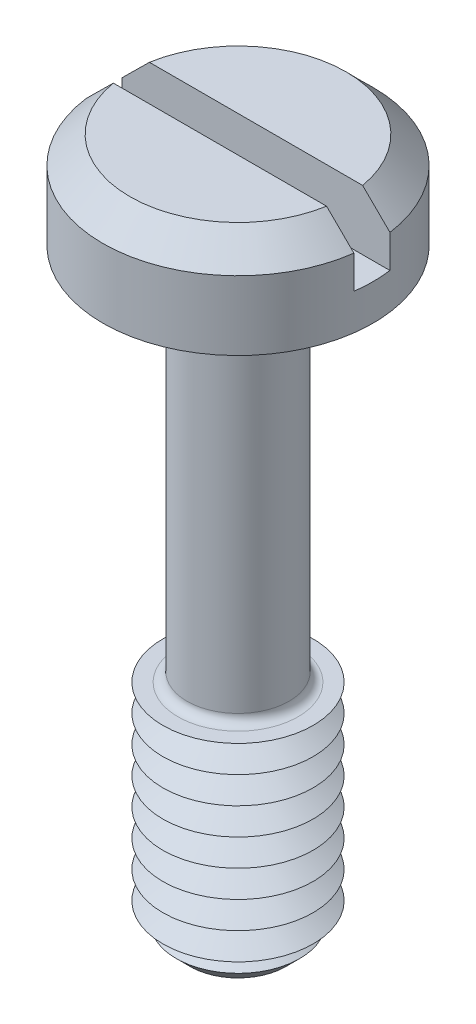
ISO-10303-21;
HEADER;
FILE_DESCRIPTION(('STEP AP214'),'2;1');
FILE_NAME('part.step','',(''),(''),'','','');
FILE_SCHEMA(('AUTOMOTIVE_DESIGN { 1 0 10303 214 1 1 1 1 }'));
ENDSEC;
DATA;
#1=APPLICATION_CONTEXT('core data for automotive mechanical design processes');
#2=APPLICATION_PROTOCOL_DEFINITION('international standard','automotive_design',2000,#1);
#3=PRODUCT_CONTEXT('',#1,'mechanical');
#4=PRODUCT('Part','Part','',(#3));
#5=PRODUCT_RELATED_PRODUCT_CATEGORY('part','',(#4));
#6=PRODUCT_DEFINITION_FORMATION('','',#4);
#7=PRODUCT_DEFINITION_CONTEXT('part definition',#1,'design');
#8=PRODUCT_DEFINITION('design','',#6,#7);
#9=PRODUCT_DEFINITION_SHAPE('','',#8);
#10=(LENGTH_UNIT() NAMED_UNIT(*) SI_UNIT(.MILLI.,.METRE.));
#11=(NAMED_UNIT(*) PLANE_ANGLE_UNIT() SI_UNIT($,.RADIAN.));
#12=(NAMED_UNIT(*) SI_UNIT($,.STERADIAN.) SOLID_ANGLE_UNIT());
#13=UNCERTAINTY_MEASURE_WITH_UNIT(LENGTH_MEASURE(1.E-05),#10,'distance_accuracy_value','');
#14=(GEOMETRIC_REPRESENTATION_CONTEXT(3) GLOBAL_UNCERTAINTY_ASSIGNED_CONTEXT((#13)) GLOBAL_UNIT_ASSIGNED_CONTEXT((#10,
#11,#12)) REPRESENTATION_CONTEXT('',''));
#15=CARTESIAN_POINT('',(0.,0.,0.));
#16=DIRECTION('',(0.,0.,1.));
#17=DIRECTION('',(1.,0.,0.));
#18=AXIS2_PLACEMENT_3D('',#15,#16,#17);
#19=CARTESIAN_POINT('',(0.,1.6,0.));
#20=DIRECTION('',(0.,1.,0.));
#21=DIRECTION('',(0.,0.,1.));
#22=AXIS2_PLACEMENT_3D('',#19,#20,#21);
#23=PLANE('',#22);
#24=DIRECTION('',(-1.,0.,0.));
#25=VECTOR('',#24,1.);
#26=CARTESIAN_POINT('',(2.25,1.6,-0.3));
#27=LINE('',#26,#25);
#28=CARTESIAN_POINT('',(1.77482393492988,1.6,-0.3));
#29=VERTEX_POINT('',#28);
#30=CARTESIAN_POINT('',(-1.77482393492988,1.6,-0.3));
#31=VERTEX_POINT('',#30);
#32=EDGE_CURVE('E110',#29,#31,#27,.T.);
#33=ORIENTED_EDGE('',*,*,#32,.F.);
#34=CARTESIAN_POINT('',(0.,1.6,0.));
#35=DIRECTION('',(0.,1.,0.));
#36=DIRECTION('',(0.,0.,1.));
#37=AXIS2_PLACEMENT_3D('',#34,#35,#36);
#38=CIRCLE('',#37,1.8);
#39=EDGE_CURVE('E113',#29,#31,#38,.T.);
#40=ORIENTED_EDGE('',*,*,#39,.T.);
#41=EDGE_LOOP('',(#33,#40));
#42=FACE_BOUND('',#41,.T.);
#43=ADVANCED_FACE('F39',(#42),#23,.T.);
#44=CARTESIAN_POINT('',(0.,1.6,0.));
#45=DIRECTION('',(0.,-1.,0.));
#46=DIRECTION('',(0.,0.,-1.));
#47=AXIS2_PLACEMENT_3D('',#44,#45,#46);
#48=CONICAL_SURFACE('',#47,1.8,0.785398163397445);
#49=CARTESIAN_POINT('',(4.95459224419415,-1.56366641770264,-0.3));
#50=CARTESIAN_POINT('',(4.78550585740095,-1.39489159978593,-0.3));
#51=CARTESIAN_POINT('',(4.6164059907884,-1.22613027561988,-0.3));
#52=CARTESIAN_POINT('',(4.27815962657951,-0.888649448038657,-0.3));
#53=CARTESIAN_POINT('',(4.10901312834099,-0.719929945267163,-0.3));
#54=CARTESIAN_POINT('',(3.77060374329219,-0.38249765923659,-0.3));
#55=CARTESIAN_POINT('',(3.60134083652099,-0.21378489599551,-0.3));
#56=CARTESIAN_POINT('',(3.26272497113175,0.123545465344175,-0.3));
#57=CARTESIAN_POINT('',(3.09337201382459,0.292163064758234,-0.3));
#58=CARTESIAN_POINT('',(2.74975444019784,0.6339858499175,-0.3));
#59=CARTESIAN_POINT('',(2.57548557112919,0.807186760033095,-0.3));
#60=CARTESIAN_POINT('',(2.22666801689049,1.15332162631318,-0.3));
#61=CARTESIAN_POINT('',(2.05211932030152,1.32625557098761,-0.3));
#62=CARTESIAN_POINT('',(1.78988225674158,1.58520097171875,-0.3));
#63=CARTESIAN_POINT('',(1.70241000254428,1.67143125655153,-0.3));
#64=CARTESIAN_POINT('',(1.52723599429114,1.84366185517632,-0.3));
#65=CARTESIAN_POINT('',(1.43953423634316,1.92966216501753,-0.3));
#66=CARTESIAN_POINT('',(1.26375483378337,2.10126365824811,-0.3));
#67=CARTESIAN_POINT('',(1.17567721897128,2.18686487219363,-0.3));
#68=CARTESIAN_POINT('',(0.998839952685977,2.35735922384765,-0.3));
#69=CARTESIAN_POINT('',(0.910080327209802,2.44225238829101,-0.3));
#70=CARTESIAN_POINT('',(0.796416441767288,2.54899153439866,-0.3));
#71=CARTESIAN_POINT('',(0.772225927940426,2.57159630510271,-0.3));
#72=CARTESIAN_POINT('',(0.723692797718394,2.61664290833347,-0.3));
#73=CARTESIAN_POINT('',(0.699350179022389,2.63908473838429,-0.3));
#74=CARTESIAN_POINT('',(0.650528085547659,2.68369783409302,-0.3));
#75=CARTESIAN_POINT('',(0.626049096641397,2.70586963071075,-0.3));
#76=CARTESIAN_POINT('',(0.576826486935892,2.74991696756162,-0.3));
#77=CARTESIAN_POINT('',(0.552082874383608,2.7717925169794,-0.3));
#78=CARTESIAN_POINT('',(0.495367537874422,2.82108684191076,-0.3));
#79=CARTESIAN_POINT('',(0.463281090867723,2.84837386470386,-0.3));
#80=CARTESIAN_POINT('',(0.398023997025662,2.90193742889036,-0.3));
#81=CARTESIAN_POINT('',(0.364849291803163,2.92820913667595,-0.3));
#82=CARTESIAN_POINT('',(0.313679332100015,2.96610502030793,-0.3));
#83=CARTESIAN_POINT('',(0.296293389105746,2.97854603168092,-0.3));
#84=CARTESIAN_POINT('',(0.260958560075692,3.00259516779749,-0.3));
#85=CARTESIAN_POINT('',(0.243009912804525,3.01420363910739,-0.3));
#86=CARTESIAN_POINT('',(0.206442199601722,3.0361249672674,-0.3));
#87=CARTESIAN_POINT('',(0.187826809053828,3.04644383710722,-0.3));
#88=CARTESIAN_POINT('',(0.149667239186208,3.06515059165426,-0.3));
#89=CARTESIAN_POINT('',(0.130125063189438,3.0735424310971,-0.3));
#90=CARTESIAN_POINT('',(0.0899770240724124,3.08736060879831,-0.3));
#91=CARTESIAN_POINT('',(0.0693720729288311,3.09278944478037,-0.3));
#92=CARTESIAN_POINT('',(0.027564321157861,3.0994305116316,-0.3));
#93=CARTESIAN_POINT('',(0.00636584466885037,3.10066782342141,-0.3));
#94=CARTESIAN_POINT('',(-0.0358007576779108,3.09861060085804,-0.3));
#95=CARTESIAN_POINT('',(-0.0567687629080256,3.09531379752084,-0.3));
#96=CARTESIAN_POINT('',(-0.0978737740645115,3.08507807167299,-0.3));
#97=CARTESIAN_POINT('',(-0.118004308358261,3.07811501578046,-0.3));
#98=CARTESIAN_POINT('',(-0.162483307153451,3.05957916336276,-0.3));
#99=CARTESIAN_POINT('',(-0.186511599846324,3.04727044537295,-0.3));
#100=CARTESIAN_POINT('',(-0.233318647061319,3.02043354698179,-0.3));
#101=CARTESIAN_POINT('',(-0.256093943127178,3.00589960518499,-0.3));
#102=CARTESIAN_POINT('',(-0.300901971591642,2.97541580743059,-0.3));
#103=CARTESIAN_POINT('',(-0.322928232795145,2.95945657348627,-0.3));
#104=CARTESIAN_POINT('',(-0.366316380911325,2.92672827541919,-0.3));
#105=CARTESIAN_POINT('',(-0.387679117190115,2.90996032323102,-0.3));
#106=CARTESIAN_POINT('',(-0.433394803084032,2.87310399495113,-0.3));
#107=CARTESIAN_POINT('',(-0.457669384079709,2.85291891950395,-0.3));
#108=CARTESIAN_POINT('',(-0.505802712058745,2.81205752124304,-0.3));
#109=CARTESIAN_POINT('',(-0.529661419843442,2.79138115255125,-0.3));
#110=CARTESIAN_POINT('',(-0.600811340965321,2.72884009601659,-0.3));
#111=CARTESIAN_POINT('',(-0.647661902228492,2.68647545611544,-0.3));
#112=CARTESIAN_POINT('',(-0.740776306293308,2.60099002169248,-0.3));
#113=CARTESIAN_POINT('',(-0.787039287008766,2.55786829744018,-0.3));
#114=CARTESIAN_POINT('',(-0.879151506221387,2.47120207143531,-0.3));
#115=CARTESIAN_POINT('',(-0.925000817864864,2.42765764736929,-0.3));
#116=CARTESIAN_POINT('',(-1.0615734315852,2.29718252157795,-0.3));
#117=CARTESIAN_POINT('',(-1.15191647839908,2.20985470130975,-0.3));
#118=CARTESIAN_POINT('',(-1.33204374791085,2.0347474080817,-0.3));
#119=CARTESIAN_POINT('',(-1.42182830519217,1.94696827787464,-0.3));
#120=CARTESIAN_POINT('',(-1.65511823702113,1.71815111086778,-0.3));
#121=CARTESIAN_POINT('',(-1.79840096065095,1.57688614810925,-0.3));
#122=CARTESIAN_POINT('',(-2.08462326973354,1.2940074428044,-0.3));
#123=CARTESIAN_POINT('',(-2.22756285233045,1.15239369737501,-0.3));
#124=CARTESIAN_POINT('',(-2.6561839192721,0.727177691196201,-0.3));
#125=CARTESIAN_POINT('',(-2.94157972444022,0.443287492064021,-0.3));
#126=CARTESIAN_POINT('',(-3.51504981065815,-0.127735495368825,-0.3));
#127=CARTESIAN_POINT('',(-3.80312108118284,-0.414871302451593,-0.3));
#128=CARTESIAN_POINT('',(-4.37899985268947,-0.989219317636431,-0.3));
#129=CARTESIAN_POINT('',(-4.6668074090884,-1.27643147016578,-0.3));
#130=CARTESIAN_POINT('',(-4.95459224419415,-1.56366641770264,-0.3));
#131=B_SPLINE_CURVE_WITH_KNOTS('',3,(#49,#50,#51,#52,#53,#54,#55,#56,#57,#58,#59,#60,#61,#62,
#63,#64,#65,#66,#67,#68,#69,#70,#71,#72,#73,#74,#75,#76,#77,#78,#79,#80,#81,#82,#83,#84,#85,#86,
#87,#88,#89,#90,#91,#92,#93,#94,#95,#96,#97,#98,#99,#100,#101,#102,#103,#104,#105,#106,#107,
#108,#109,#110,#111,#112,#113,#114,#115,#116,#117,#118,#119,#120,#121,#122,#123,#124,#125,#126,
#127,#128,#129,#130),.UNSPECIFIED.,.F.,.F.,(4,2,2,2,2,2,2,2,2,2,2,2,2,2,2,2,2,2,2,2,2,2,2,2,2,2,
2,2,2,2,2,2,2,2,2,2,2,2,2,2,4),(0.,0.716712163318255,1.43343474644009,2.1503903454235,
2.8673357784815,3.6044339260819,4.3415629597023,4.71005096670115,5.07854526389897,
5.44701086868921,5.81546249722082,5.91478669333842,6.01411239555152,6.11319302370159,
6.21227057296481,6.33862193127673,6.46551497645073,6.52963544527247,6.59372906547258,
6.65751170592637,6.72116225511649,6.78475906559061,6.84797465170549,6.91122188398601,
6.97489074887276,7.05566851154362,7.13665907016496,7.21822852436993,7.29968885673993,
7.39438996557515,7.48909995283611,7.67857624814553,7.86830424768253,8.05799801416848,
8.43494407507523,8.81163695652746,9.41526715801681,10.0189023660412,11.2265436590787,
12.4467437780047,13.6665454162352),.UNSPECIFIED.);
#132=CARTESIAN_POINT('',(2.2299103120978,1.14999999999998,-0.3));
#133=VERTEX_POINT('',#132);
#134=EDGE_CURVE('E260',#133,#29,#131,.T.);
#135=ORIENTED_EDGE('',*,*,#134,.F.);
#136=CARTESIAN_POINT('',(0.,1.15,0.));
#137=DIRECTION('',(0.,1.,0.));
#138=DIRECTION('',(0.,0.,1.));
#139=AXIS2_PLACEMENT_3D('',#136,#137,#138);
#140=CIRCLE('',#139,2.25);
#141=CARTESIAN_POINT('',(-2.22991031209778,1.15,-0.3));
#142=VERTEX_POINT('',#141);
#143=EDGE_CURVE('E128',#142,#133,#140,.F.);
#144=ORIENTED_EDGE('',*,*,#143,.F.);
#145=EDGE_CURVE('E102',#31,#142,#131,.T.);
#146=ORIENTED_EDGE('',*,*,#145,.F.);
#147=ORIENTED_EDGE('',*,*,#39,.F.);
#148=EDGE_LOOP('',(#135,#144,#146,#147));
#149=FACE_BOUND('',#148,.T.);
#150=ADVANCED_FACE('F222',(#149),#48,.T.);
#151=CARTESIAN_POINT('',(0.,-10.,0.));
#152=DIRECTION('',(0.,1.,0.));
#153=DIRECTION('',(0.,0.,1.));
#154=AXIS2_PLACEMENT_3D('',#151,#152,#153);
#155=CYLINDRICAL_SURFACE('',#154,0.85);
#156=CARTESIAN_POINT('',(0.,-6.15,0.));
#157=DIRECTION('',(0.,-1.,0.));
#158=DIRECTION('',(0.,0.,-1.));
#159=AXIS2_PLACEMENT_3D('',#156,#157,#158);
#160=CIRCLE('',#159,0.85);
#161=CARTESIAN_POINT('',(0.,-6.15,-0.85));
#162=VERTEX_POINT('',#161);
#163=EDGE_CURVE('E123',#162,#162,#160,.F.);
#164=ORIENTED_EDGE('',*,*,#163,.T.);
#165=EDGE_LOOP('',(#164));
#166=FACE_BOUND('',#165,.T.);
#167=CARTESIAN_POINT('',(0.,-0.150000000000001,0.));
#168=DIRECTION('',(0.,1.,0.));
#169=DIRECTION('',(0.,0.,1.));
#170=AXIS2_PLACEMENT_3D('',#167,#168,#169);
#171=CIRCLE('',#170,0.85);
#172=CARTESIAN_POINT('',(0.,-0.150000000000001,0.85));
#173=VERTEX_POINT('',#172);
#174=EDGE_CURVE('E368',#173,#173,#171,.F.);
#175=ORIENTED_EDGE('',*,*,#174,.T.);
#176=EDGE_LOOP('',(#175));
#177=FACE_BOUND('',#176,.T.);
#178=ADVANCED_FACE('F218',(#166,#177),#155,.T.);
#179=CARTESIAN_POINT('',(0.,1.6,0.));
#180=DIRECTION('',(0.,-1.,0.));
#181=DIRECTION('',(0.,0.,-1.));
#182=AXIS2_PLACEMENT_3D('',#179,#180,#181);
#183=CYLINDRICAL_SURFACE('',#182,2.25);
#184=ORIENTED_EDGE('',*,*,#143,.T.);
#185=DIRECTION('',(0.,-1.,0.));
#186=VECTOR('',#185,1.);
#187=CARTESIAN_POINT('',(2.22991031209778,1.6,-0.3));
#188=LINE('',#187,#186);
#189=CARTESIAN_POINT('',(2.22991031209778,0.6,-0.3));
#190=VERTEX_POINT('',#189);
#191=EDGE_CURVE('E64',#133,#190,#188,.T.);
#192=ORIENTED_EDGE('',*,*,#191,.T.);
#193=CARTESIAN_POINT('',(0.,0.6,0.));
#194=DIRECTION('',(0.,1.,0.));
#195=DIRECTION('',(0.,0.,1.));
#196=AXIS2_PLACEMENT_3D('',#193,#194,#195);
#197=CIRCLE('',#196,2.25);
#198=CARTESIAN_POINT('',(2.22991031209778,0.6,0.3));
#199=VERTEX_POINT('',#198);
#200=EDGE_CURVE('E11',#199,#190,#197,.T.);
#201=ORIENTED_EDGE('',*,*,#200,.F.);
#202=DIRECTION('',(0.,-1.,0.));
#203=VECTOR('',#202,1.);
#204=CARTESIAN_POINT('',(2.22991031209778,1.6,0.3));
#205=LINE('',#204,#203);
#206=CARTESIAN_POINT('',(2.22991031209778,1.15,0.3));
#207=VERTEX_POINT('',#206);
#208=EDGE_CURVE('E276',#199,#207,#205,.F.);
#209=ORIENTED_EDGE('',*,*,#208,.T.);
#210=CARTESIAN_POINT('',(-2.2299103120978,1.14999999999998,0.3));
#211=VERTEX_POINT('',#210);
#212=EDGE_CURVE('E120',#207,#211,#140,.F.);
#213=ORIENTED_EDGE('',*,*,#212,.T.);
#214=DIRECTION('',(0.,-1.,0.));
#215=VECTOR('',#214,1.);
#216=CARTESIAN_POINT('',(-2.22991031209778,1.6,0.3));
#217=LINE('',#216,#215);
#218=CARTESIAN_POINT('',(-2.22991031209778,0.6,0.3));
#219=VERTEX_POINT('',#218);
#220=EDGE_CURVE('E96',#211,#219,#217,.T.);
#221=ORIENTED_EDGE('',*,*,#220,.T.);
#222=CARTESIAN_POINT('',(-2.22991031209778,0.6,-0.3));
#223=VERTEX_POINT('',#222);
#224=EDGE_CURVE('E44',#223,#219,#197,.T.);
#225=ORIENTED_EDGE('',*,*,#224,.F.);
#226=DIRECTION('',(0.,-1.,0.));
#227=VECTOR('',#226,1.);
#228=CARTESIAN_POINT('',(-2.22991031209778,1.6,-0.3));
#229=LINE('',#228,#227);
#230=EDGE_CURVE('E281',#223,#142,#229,.F.);
#231=ORIENTED_EDGE('',*,*,#230,.T.);
#232=EDGE_LOOP('',(#184,#192,#201,#209,#213,#221,#225,#231));
#233=FACE_BOUND('',#232,.T.);
#234=CARTESIAN_POINT('',(0.,0.,0.));
#235=DIRECTION('',(0.,1.,0.));
#236=DIRECTION('',(0.,0.,1.));
#237=AXIS2_PLACEMENT_3D('',#234,#235,#236);
#238=CIRCLE('',#237,2.25);
#239=CARTESIAN_POINT('',(0.,0.,2.25));
#240=VERTEX_POINT('',#239);
#241=EDGE_CURVE('E354',#240,#240,#238,.T.);
#242=ORIENTED_EDGE('',*,*,#241,.T.);
#243=EDGE_LOOP('',(#242));
#244=FACE_BOUND('',#243,.T.);
#245=ADVANCED_FACE('F221',(#233,#244),#183,.T.);
#246=DIRECTION('',(1.,0.,0.));
#247=VECTOR('',#246,1.);
#248=CARTESIAN_POINT('',(2.25,1.6,0.3));
#249=LINE('',#248,#247);
#250=CARTESIAN_POINT('',(-1.77482393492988,1.6,0.3));
#251=VERTEX_POINT('',#250);
#252=CARTESIAN_POINT('',(1.77482393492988,1.6,0.3));
#253=VERTEX_POINT('',#252);
#254=EDGE_CURVE('E56',#251,#253,#249,.T.);
#255=ORIENTED_EDGE('',*,*,#254,.F.);
#256=EDGE_CURVE('E108',#251,#253,#38,.T.);
#257=ORIENTED_EDGE('',*,*,#256,.T.);
#258=EDGE_LOOP('',(#255,#257));
#259=FACE_BOUND('',#258,.T.);
#260=ADVANCED_FACE('F107',(#259),#23,.T.);
#261=CARTESIAN_POINT('',(0.,0.,0.));
#262=DIRECTION('',(0.,1.,0.));
#263=DIRECTION('',(0.,0.,1.));
#264=AXIS2_PLACEMENT_3D('',#261,#262,#263);
#265=PLANE('',#264);
#266=CARTESIAN_POINT('',(0.,0.,0.));
#267=DIRECTION('',(0.,1.,0.));
#268=DIRECTION('',(0.,0.,1.));
#269=AXIS2_PLACEMENT_3D('',#266,#267,#268);
#270=CIRCLE('',#269,1.);
#271=CARTESIAN_POINT('',(0.,0.,1.));
#272=VERTEX_POINT('',#271);
#273=EDGE_CURVE('E114',#272,#272,#270,.T.);
#274=ORIENTED_EDGE('',*,*,#273,.T.);
#275=EDGE_LOOP('',(#274));
#276=FACE_BOUND('',#275,.T.);
#277=ORIENTED_EDGE('',*,*,#241,.F.);
#278=EDGE_LOOP('',(#277));
#279=FACE_BOUND('',#278,.T.);
#280=ADVANCED_FACE('F212',(#276,#279),#265,.F.);
#281=CARTESIAN_POINT('',(0.,-6.3,0.));
#282=DIRECTION('',(0.,-1.,0.));
#283=DIRECTION('',(0.,0.,-1.));
#284=AXIS2_PLACEMENT_3D('',#281,#282,#283);
#285=PLANE('',#284);
#286=CARTESIAN_POINT('',(0.,-6.3,0.));
#287=DIRECTION('',(0.,-1.,0.));
#288=DIRECTION('',(0.,0.,-1.));
#289=AXIS2_PLACEMENT_3D('',#286,#287,#288);
#290=CIRCLE('',#289,1.);
#291=CARTESIAN_POINT('',(0.,-6.3,-1.));
#292=VERTEX_POINT('',#291);
#293=EDGE_CURVE('E362',#292,#292,#290,.T.);
#294=ORIENTED_EDGE('',*,*,#293,.T.);
#295=EDGE_LOOP('',(#294));
#296=FACE_BOUND('',#295,.T.);
#297=CARTESIAN_POINT('',(0.,-6.3,0.));
#298=DIRECTION('',(0.,1.,0.));
#299=DIRECTION('',(0.,0.,1.));
#300=AXIS2_PLACEMENT_3D('',#297,#298,#299);
#301=CIRCLE('',#300,1.25);
#302=CARTESIAN_POINT('',(0.,-6.3,1.25));
#303=VERTEX_POINT('',#302);
#304=EDGE_CURVE('E350',#303,#303,#301,.T.);
#305=ORIENTED_EDGE('',*,*,#304,.T.);
#306=EDGE_LOOP('',(#305));
#307=FACE_BOUND('',#306,.T.);
#308=ADVANCED_FACE('F208',(#296,#307),#285,.F.);
#309=CARTESIAN_POINT('',(0.,-6.525,0.));
#310=DIRECTION('',(0.,1.,0.));
#311=DIRECTION('',(0.,0.,1.));
#312=AXIS2_PLACEMENT_3D('',#309,#310,#311);
#313=CONICAL_SURFACE('',#312,0.860288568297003,1.0471975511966);
#314=ORIENTED_EDGE('',*,*,#304,.F.);
#315=EDGE_LOOP('',(#314));
#316=FACE_BOUND('',#315,.T.);
#317=CARTESIAN_POINT('',(0.,-6.525,0.));
#318=DIRECTION('',(0.,1.,0.));
#319=DIRECTION('',(0.,0.,1.));
#320=AXIS2_PLACEMENT_3D('',#317,#318,#319);
#321=CIRCLE('',#320,0.860288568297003);
#322=CARTESIAN_POINT('',(0.,-6.525,0.860288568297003));
#323=VERTEX_POINT('',#322);
#324=EDGE_CURVE('E346',#323,#323,#321,.T.);
#325=ORIENTED_EDGE('',*,*,#324,.T.);
#326=EDGE_LOOP('',(#325));
#327=FACE_BOUND('',#326,.T.);
#328=ADVANCED_FACE('F204',(#316,#327),#313,.T.);
#329=CARTESIAN_POINT('',(0.,-6.75,0.));
#330=DIRECTION('',(0.,-1.,0.));
#331=DIRECTION('',(0.,0.,-1.));
#332=AXIS2_PLACEMENT_3D('',#329,#330,#331);
#333=CONICAL_SURFACE('',#332,1.25,1.0471975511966);
#334=ORIENTED_EDGE('',*,*,#324,.F.);
#335=EDGE_LOOP('',(#334));
#336=FACE_BOUND('',#335,.T.);
#337=CARTESIAN_POINT('',(0.,-6.75,0.));
#338=DIRECTION('',(0.,1.,0.));
#339=DIRECTION('',(0.,0.,1.));
#340=AXIS2_PLACEMENT_3D('',#337,#338,#339);
#341=CIRCLE('',#340,1.25);
#342=CARTESIAN_POINT('',(0.,-6.75,1.25));
#343=VERTEX_POINT('',#342);
#344=EDGE_CURVE('E342',#343,#343,#341,.T.);
#345=ORIENTED_EDGE('',*,*,#344,.T.);
#346=EDGE_LOOP('',(#345));
#347=FACE_BOUND('',#346,.T.);
#348=ADVANCED_FACE('F200',(#336,#347),#333,.T.);
#349=CARTESIAN_POINT('',(0.,-6.975,0.));
#350=DIRECTION('',(0.,1.,0.));
#351=DIRECTION('',(0.,0.,1.));
#352=AXIS2_PLACEMENT_3D('',#349,#350,#351);
#353=CONICAL_SURFACE('',#352,0.860288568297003,1.0471975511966);
#354=ORIENTED_EDGE('',*,*,#344,.F.);
#355=EDGE_LOOP('',(#354));
#356=FACE_BOUND('',#355,.T.);
#357=CARTESIAN_POINT('',(0.,-6.975,0.));
#358=DIRECTION('',(0.,1.,0.));
#359=DIRECTION('',(0.,0.,1.));
#360=AXIS2_PLACEMENT_3D('',#357,#358,#359);
#361=CIRCLE('',#360,0.860288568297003);
#362=CARTESIAN_POINT('',(0.,-6.975,0.860288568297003));
#363=VERTEX_POINT('',#362);
#364=EDGE_CURVE('E338',#363,#363,#361,.T.);
#365=ORIENTED_EDGE('',*,*,#364,.T.);
#366=EDGE_LOOP('',(#365));
#367=FACE_BOUND('',#366,.T.);
#368=ADVANCED_FACE('F196',(#356,#367),#353,.T.);
#369=CARTESIAN_POINT('',(0.,-7.2,0.));
#370=DIRECTION('',(0.,-1.,0.));
#371=DIRECTION('',(0.,0.,-1.));
#372=AXIS2_PLACEMENT_3D('',#369,#370,#371);
#373=CONICAL_SURFACE('',#372,1.25,1.0471975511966);
#374=ORIENTED_EDGE('',*,*,#364,.F.);
#375=EDGE_LOOP('',(#374));
#376=FACE_BOUND('',#375,.T.);
#377=CARTESIAN_POINT('',(0.,-7.2,0.));
#378=DIRECTION('',(0.,1.,0.));
#379=DIRECTION('',(0.,0.,1.));
#380=AXIS2_PLACEMENT_3D('',#377,#378,#379);
#381=CIRCLE('',#380,1.25);
#382=CARTESIAN_POINT('',(0.,-7.2,1.25));
#383=VERTEX_POINT('',#382);
#384=EDGE_CURVE('E335',#383,#383,#381,.T.);
#385=ORIENTED_EDGE('',*,*,#384,.T.);
#386=EDGE_LOOP('',(#385));
#387=FACE_BOUND('',#386,.T.);
#388=ADVANCED_FACE('F192',(#376,#387),#373,.T.);
#389=CARTESIAN_POINT('',(0.,-7.425,0.));
#390=DIRECTION('',(0.,1.,0.));
#391=DIRECTION('',(0.,0.,1.));
#392=AXIS2_PLACEMENT_3D('',#389,#390,#391);
#393=CONICAL_SURFACE('',#392,0.860288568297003,1.0471975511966);
#394=ORIENTED_EDGE('',*,*,#384,.F.);
#395=EDGE_LOOP('',(#394));
#396=FACE_BOUND('',#395,.T.);
#397=CARTESIAN_POINT('',(0.,-7.425,0.));
#398=DIRECTION('',(0.,1.,0.));
#399=DIRECTION('',(0.,0.,1.));
#400=AXIS2_PLACEMENT_3D('',#397,#398,#399);
#401=CIRCLE('',#400,0.860288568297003);
#402=CARTESIAN_POINT('',(0.,-7.425,0.860288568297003));
#403=VERTEX_POINT('',#402);
#404=EDGE_CURVE('E331',#403,#403,#401,.T.);
#405=ORIENTED_EDGE('',*,*,#404,.T.);
#406=EDGE_LOOP('',(#405));
#407=FACE_BOUND('',#406,.T.);
#408=ADVANCED_FACE('F188',(#396,#407),#393,.T.);
#409=CARTESIAN_POINT('',(0.,-7.65,0.));
#410=DIRECTION('',(0.,-1.,0.));
#411=DIRECTION('',(0.,0.,-1.));
#412=AXIS2_PLACEMENT_3D('',#409,#410,#411);
#413=CONICAL_SURFACE('',#412,1.25,1.0471975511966);
#414=ORIENTED_EDGE('',*,*,#404,.F.);
#415=EDGE_LOOP('',(#414));
#416=FACE_BOUND('',#415,.T.);
#417=CARTESIAN_POINT('',(0.,-7.65,0.));
#418=DIRECTION('',(0.,1.,0.));
#419=DIRECTION('',(0.,0.,1.));
#420=AXIS2_PLACEMENT_3D('',#417,#418,#419);
#421=CIRCLE('',#420,1.25);
#422=CARTESIAN_POINT('',(0.,-7.65,1.25));
#423=VERTEX_POINT('',#422);
#424=EDGE_CURVE('E327',#423,#423,#421,.T.);
#425=ORIENTED_EDGE('',*,*,#424,.T.);
#426=EDGE_LOOP('',(#425));
#427=FACE_BOUND('',#426,.T.);
#428=ADVANCED_FACE('F184',(#416,#427),#413,.T.);
#429=CARTESIAN_POINT('',(0.,-7.875,0.));
#430=DIRECTION('',(0.,1.,0.));
#431=DIRECTION('',(0.,0.,1.));
#432=AXIS2_PLACEMENT_3D('',#429,#430,#431);
#433=CONICAL_SURFACE('',#432,0.860288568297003,1.0471975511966);
#434=ORIENTED_EDGE('',*,*,#424,.F.);
#435=EDGE_LOOP('',(#434));
#436=FACE_BOUND('',#435,.T.);
#437=CARTESIAN_POINT('',(0.,-7.875,0.));
#438=DIRECTION('',(0.,1.,0.));
#439=DIRECTION('',(0.,0.,1.));
#440=AXIS2_PLACEMENT_3D('',#437,#438,#439);
#441=CIRCLE('',#440,0.860288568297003);
#442=CARTESIAN_POINT('',(0.,-7.875,0.860288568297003));
#443=VERTEX_POINT('',#442);
#444=EDGE_CURVE('E323',#443,#443,#441,.T.);
#445=ORIENTED_EDGE('',*,*,#444,.T.);
#446=EDGE_LOOP('',(#445));
#447=FACE_BOUND('',#446,.T.);
#448=ADVANCED_FACE('F180',(#436,#447),#433,.T.);
#449=CARTESIAN_POINT('',(0.,-8.1,0.));
#450=DIRECTION('',(0.,-1.,0.));
#451=DIRECTION('',(0.,0.,-1.));
#452=AXIS2_PLACEMENT_3D('',#449,#450,#451);
#453=CONICAL_SURFACE('',#452,1.25,1.0471975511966);
#454=ORIENTED_EDGE('',*,*,#444,.F.);
#455=EDGE_LOOP('',(#454));
#456=FACE_BOUND('',#455,.T.);
#457=CARTESIAN_POINT('',(0.,-8.1,0.));
#458=DIRECTION('',(0.,1.,0.));
#459=DIRECTION('',(0.,0.,1.));
#460=AXIS2_PLACEMENT_3D('',#457,#458,#459);
#461=CIRCLE('',#460,1.25);
#462=CARTESIAN_POINT('',(0.,-8.1,1.25));
#463=VERTEX_POINT('',#462);
#464=EDGE_CURVE('E320',#463,#463,#461,.T.);
#465=ORIENTED_EDGE('',*,*,#464,.T.);
#466=EDGE_LOOP('',(#465));
#467=FACE_BOUND('',#466,.T.);
#468=ADVANCED_FACE('F176',(#456,#467),#453,.T.);
#469=CARTESIAN_POINT('',(0.,-8.325,0.));
#470=DIRECTION('',(0.,1.,0.));
#471=DIRECTION('',(0.,0.,1.));
#472=AXIS2_PLACEMENT_3D('',#469,#470,#471);
#473=CONICAL_SURFACE('',#472,0.860288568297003,1.0471975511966);
#474=ORIENTED_EDGE('',*,*,#464,.F.);
#475=EDGE_LOOP('',(#474));
#476=FACE_BOUND('',#475,.T.);
#477=CARTESIAN_POINT('',(0.,-8.325,0.));
#478=DIRECTION('',(0.,1.,0.));
#479=DIRECTION('',(0.,0.,1.));
#480=AXIS2_PLACEMENT_3D('',#477,#478,#479);
#481=CIRCLE('',#480,0.860288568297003);
#482=CARTESIAN_POINT('',(0.,-8.325,0.860288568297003));
#483=VERTEX_POINT('',#482);
#484=EDGE_CURVE('E316',#483,#483,#481,.T.);
#485=ORIENTED_EDGE('',*,*,#484,.T.);
#486=EDGE_LOOP('',(#485));
#487=FACE_BOUND('',#486,.T.);
#488=ADVANCED_FACE('F172',(#476,#487),#473,.T.);
#489=CARTESIAN_POINT('',(0.,-8.55,0.));
#490=DIRECTION('',(0.,-1.,0.));
#491=DIRECTION('',(0.,0.,-1.));
#492=AXIS2_PLACEMENT_3D('',#489,#490,#491);
#493=CONICAL_SURFACE('',#492,1.25,1.0471975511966);
#494=ORIENTED_EDGE('',*,*,#484,.F.);
#495=EDGE_LOOP('',(#494));
#496=FACE_BOUND('',#495,.T.);
#497=CARTESIAN_POINT('',(0.,-8.55,0.));
#498=DIRECTION('',(0.,1.,0.));
#499=DIRECTION('',(0.,0.,1.));
#500=AXIS2_PLACEMENT_3D('',#497,#498,#499);
#501=CIRCLE('',#500,1.25);
#502=CARTESIAN_POINT('',(0.,-8.55,1.25));
#503=VERTEX_POINT('',#502);
#504=EDGE_CURVE('E312',#503,#503,#501,.T.);
#505=ORIENTED_EDGE('',*,*,#504,.T.);
#506=EDGE_LOOP('',(#505));
#507=FACE_BOUND('',#506,.T.);
#508=ADVANCED_FACE('F168',(#496,#507),#493,.T.);
#509=CARTESIAN_POINT('',(0.,-8.775,0.));
#510=DIRECTION('',(0.,1.,0.));
#511=DIRECTION('',(0.,0.,1.));
#512=AXIS2_PLACEMENT_3D('',#509,#510,#511);
#513=CONICAL_SURFACE('',#512,0.860288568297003,1.0471975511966);
#514=ORIENTED_EDGE('',*,*,#504,.F.);
#515=EDGE_LOOP('',(#514));
#516=FACE_BOUND('',#515,.T.);
#517=CARTESIAN_POINT('',(0.,-8.775,0.));
#518=DIRECTION('',(0.,1.,0.));
#519=DIRECTION('',(0.,0.,1.));
#520=AXIS2_PLACEMENT_3D('',#517,#518,#519);
#521=CIRCLE('',#520,0.860288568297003);
#522=CARTESIAN_POINT('',(0.,-8.775,0.860288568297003));
#523=VERTEX_POINT('',#522);
#524=EDGE_CURVE('E309',#523,#523,#521,.T.);
#525=ORIENTED_EDGE('',*,*,#524,.T.);
#526=EDGE_LOOP('',(#525));
#527=FACE_BOUND('',#526,.T.);
#528=ADVANCED_FACE('F164',(#516,#527),#513,.T.);
#529=CARTESIAN_POINT('',(0.,-9.,0.));
#530=DIRECTION('',(0.,-1.,0.));
#531=DIRECTION('',(0.,0.,-1.));
#532=AXIS2_PLACEMENT_3D('',#529,#530,#531);
#533=CONICAL_SURFACE('',#532,1.25,1.0471975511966);
#534=ORIENTED_EDGE('',*,*,#524,.F.);
#535=EDGE_LOOP('',(#534));
#536=FACE_BOUND('',#535,.T.);
#537=CARTESIAN_POINT('',(0.,-9.,0.));
#538=DIRECTION('',(0.,1.,0.));
#539=DIRECTION('',(0.,0.,1.));
#540=AXIS2_PLACEMENT_3D('',#537,#538,#539);
#541=CIRCLE('',#540,1.25);
#542=CARTESIAN_POINT('',(0.,-9.,1.25));
#543=VERTEX_POINT('',#542);
#544=EDGE_CURVE('E305',#543,#543,#541,.T.);
#545=ORIENTED_EDGE('',*,*,#544,.T.);
#546=EDGE_LOOP('',(#545));
#547=FACE_BOUND('',#546,.T.);
#548=ADVANCED_FACE('F160',(#536,#547),#533,.T.);
#549=CARTESIAN_POINT('',(0.,-9.225,0.));
#550=DIRECTION('',(0.,1.,0.));
#551=DIRECTION('',(0.,0.,1.));
#552=AXIS2_PLACEMENT_3D('',#549,#550,#551);
#553=CONICAL_SURFACE('',#552,0.860288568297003,1.0471975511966);
#554=ORIENTED_EDGE('',*,*,#544,.F.);
#555=EDGE_LOOP('',(#554));
#556=FACE_BOUND('',#555,.T.);
#557=CARTESIAN_POINT('',(0.,-9.225,0.));
#558=DIRECTION('',(0.,1.,0.));
#559=DIRECTION('',(0.,0.,1.));
#560=AXIS2_PLACEMENT_3D('',#557,#558,#559);
#561=CIRCLE('',#560,0.860288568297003);
#562=CARTESIAN_POINT('',(0.,-9.225,0.860288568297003));
#563=VERTEX_POINT('',#562);
#564=EDGE_CURVE('E301',#563,#563,#561,.T.);
#565=ORIENTED_EDGE('',*,*,#564,.T.);
#566=EDGE_LOOP('',(#565));
#567=FACE_BOUND('',#566,.T.);
#568=ADVANCED_FACE('F156',(#556,#567),#553,.T.);
#569=CARTESIAN_POINT('',(0.,-9.45,0.));
#570=DIRECTION('',(0.,-1.,0.));
#571=DIRECTION('',(0.,0.,-1.));
#572=AXIS2_PLACEMENT_3D('',#569,#570,#571);
#573=CONICAL_SURFACE('',#572,1.25,1.0471975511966);
#574=ORIENTED_EDGE('',*,*,#564,.F.);
#575=EDGE_LOOP('',(#574));
#576=FACE_BOUND('',#575,.T.);
#577=CARTESIAN_POINT('',(0.,-9.45,0.));
#578=DIRECTION('',(0.,1.,0.));
#579=DIRECTION('',(0.,0.,1.));
#580=AXIS2_PLACEMENT_3D('',#577,#578,#579);
#581=CIRCLE('',#580,1.25);
#582=CARTESIAN_POINT('',(0.,-9.45,1.25));
#583=VERTEX_POINT('',#582);
#584=EDGE_CURVE('E296',#583,#583,#581,.T.);
#585=ORIENTED_EDGE('',*,*,#584,.T.);
#586=EDGE_LOOP('',(#585));
#587=FACE_BOUND('',#586,.T.);
#588=ADVANCED_FACE('F152',(#576,#587),#573,.T.);
#589=CARTESIAN_POINT('',(0.,-9.675,0.));
#590=DIRECTION('',(0.,1.,0.));
#591=DIRECTION('',(0.,0.,1.));
#592=AXIS2_PLACEMENT_3D('',#589,#590,#591);
#593=CONICAL_SURFACE('',#592,0.860288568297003,1.0471975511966);
#594=ORIENTED_EDGE('',*,*,#584,.F.);
#595=EDGE_LOOP('',(#594));
#596=FACE_BOUND('',#595,.T.);
#597=CARTESIAN_POINT('',(0.,-9.675,0.));
#598=DIRECTION('',(0.,1.,0.));
#599=DIRECTION('',(0.,0.,1.));
#600=AXIS2_PLACEMENT_3D('',#597,#598,#599);
#601=CIRCLE('',#600,0.860288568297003);
#602=CARTESIAN_POINT('',(0.,-9.675,0.860288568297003));
#603=VERTEX_POINT('',#602);
#604=EDGE_CURVE('E292',#603,#603,#601,.T.);
#605=ORIENTED_EDGE('',*,*,#604,.T.);
#606=EDGE_LOOP('',(#605));
#607=FACE_BOUND('',#606,.T.);
#608=ADVANCED_FACE('F148',(#596,#607),#593,.T.);
#609=CARTESIAN_POINT('',(0.,-9.9,0.));
#610=DIRECTION('',(0.,-1.,0.));
#611=DIRECTION('',(0.,0.,-1.));
#612=AXIS2_PLACEMENT_3D('',#609,#610,#611);
#613=CONICAL_SURFACE('',#612,1.25,1.0471975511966);
#614=CARTESIAN_POINT('',(0.,-9.77189110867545,0.));
#615=DIRECTION('',(0.,-1.,0.));
#616=DIRECTION('',(0.,0.,-1.));
#617=AXIS2_PLACEMENT_3D('',#614,#615,#616);
#618=CIRCLE('',#617,1.02810889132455);
#619=CARTESIAN_POINT('',(0.,-9.77189110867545,-1.02810889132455));
#620=VERTEX_POINT('',#619);
#621=EDGE_CURVE('E300',#620,#620,#618,.F.);
#622=ORIENTED_EDGE('',*,*,#621,.T.);
#623=EDGE_LOOP('',(#622));
#624=FACE_BOUND('',#623,.T.);
#625=ORIENTED_EDGE('',*,*,#604,.F.);
#626=EDGE_LOOP('',(#625));
#627=FACE_BOUND('',#626,.T.);
#628=ADVANCED_FACE('F144',(#624,#627),#613,.T.);
#629=CARTESIAN_POINT('',(0.,-10.,0.));
#630=DIRECTION('',(0.,-1.,0.));
#631=DIRECTION('',(0.,0.,-1.));
#632=AXIS2_PLACEMENT_3D('',#629,#630,#631);
#633=PLANE('',#632);
#634=CARTESIAN_POINT('',(0.,-10.,0.));
#635=DIRECTION('',(0.,-1.,0.));
#636=DIRECTION('',(0.,0.,-1.));
#637=AXIS2_PLACEMENT_3D('',#634,#635,#636);
#638=CIRCLE('',#637,0.800000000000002);
#639=CARTESIAN_POINT('',(0.,-10.,-0.800000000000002));
#640=VERTEX_POINT('',#639);
#641=EDGE_CURVE('E358',#640,#640,#638,.T.);
#642=ORIENTED_EDGE('',*,*,#641,.T.);
#643=EDGE_LOOP('',(#642));
#644=FACE_BOUND('',#643,.T.);
#645=ADVANCED_FACE('F147',(#644),#633,.T.);
#646=CARTESIAN_POINT('',(0.,-10.,0.));
#647=DIRECTION('',(0.,1.,0.));
#648=DIRECTION('',(0.,0.,1.));
#649=AXIS2_PLACEMENT_3D('',#646,#647,#648);
#650=CONICAL_SURFACE('',#649,0.800000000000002,0.785398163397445);
#651=ORIENTED_EDGE('',*,*,#621,.F.);
#652=EDGE_LOOP('',(#651));
#653=FACE_BOUND('',#652,.T.);
#654=ORIENTED_EDGE('',*,*,#641,.F.);
#655=EDGE_LOOP('',(#654));
#656=FACE_BOUND('',#655,.T.);
#657=ADVANCED_FACE('F216',(#653,#656),#650,.T.);
#658=CARTESIAN_POINT('',(0.,-6.15,0.));
#659=DIRECTION('',(0.,-1.,0.));
#660=DIRECTION('',(0.,0.,-1.));
#661=AXIS2_PLACEMENT_3D('',#658,#659,#660);
#662=TOROIDAL_SURFACE('',#661,1.,0.15);
#663=ORIENTED_EDGE('',*,*,#163,.F.);
#664=EDGE_LOOP('',(#663));
#665=FACE_BOUND('',#664,.T.);
#666=ORIENTED_EDGE('',*,*,#293,.F.);
#667=EDGE_LOOP('',(#666));
#668=FACE_BOUND('',#667,.T.);
#669=ADVANCED_FACE('F234',(#665,#668),#662,.F.);
#670=CARTESIAN_POINT('',(0.,-0.150000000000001,0.));
#671=DIRECTION('',(0.,1.,0.));
#672=DIRECTION('',(0.,0.,1.));
#673=AXIS2_PLACEMENT_3D('',#670,#671,#672);
#674=TOROIDAL_SURFACE('',#673,1.,0.15);
#675=ORIENTED_EDGE('',*,*,#273,.F.);
#676=EDGE_LOOP('',(#675));
#677=FACE_BOUND('',#676,.T.);
#678=ORIENTED_EDGE('',*,*,#174,.F.);
#679=EDGE_LOOP('',(#678));
#680=FACE_BOUND('',#679,.T.);
#681=ADVANCED_FACE('F237',(#677,#680),#674,.F.);
#682=CARTESIAN_POINT('',(-4.95459224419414,-1.56366641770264,0.3));
#683=CARTESIAN_POINT('',(-4.78550585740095,-1.39489159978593,0.3));
#684=CARTESIAN_POINT('',(-4.6164059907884,-1.22613027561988,0.3));
#685=CARTESIAN_POINT('',(-4.27815962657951,-0.888649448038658,0.3));
#686=CARTESIAN_POINT('',(-4.10901312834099,-0.719929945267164,0.3));
#687=CARTESIAN_POINT('',(-3.77060374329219,-0.382497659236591,0.3));
#688=CARTESIAN_POINT('',(-3.601340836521,-0.21378489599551,0.3));
#689=CARTESIAN_POINT('',(-3.26272497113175,0.123545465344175,0.3));
#690=CARTESIAN_POINT('',(-3.09337201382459,0.292163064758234,0.3));
#691=CARTESIAN_POINT('',(-2.74975444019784,0.6339858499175,0.3));
#692=CARTESIAN_POINT('',(-2.57548557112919,0.807186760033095,0.3));
#693=CARTESIAN_POINT('',(-2.22666801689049,1.15332162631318,0.3));
#694=CARTESIAN_POINT('',(-2.05211932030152,1.32625557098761,0.3));
#695=CARTESIAN_POINT('',(-1.78988225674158,1.58520097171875,0.3));
#696=CARTESIAN_POINT('',(-1.70241000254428,1.67143125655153,0.3));
#697=CARTESIAN_POINT('',(-1.52723599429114,1.84366185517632,0.3));
#698=CARTESIAN_POINT('',(-1.43953423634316,1.92966216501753,0.3));
#699=CARTESIAN_POINT('',(-1.26375483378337,2.10126365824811,0.3));
#700=CARTESIAN_POINT('',(-1.17567721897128,2.18686487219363,0.3));
#701=CARTESIAN_POINT('',(-0.998839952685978,2.35735922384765,0.3));
#702=CARTESIAN_POINT('',(-0.910080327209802,2.44225238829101,0.3));
#703=CARTESIAN_POINT('',(-0.796416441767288,2.54899153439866,0.3));
#704=CARTESIAN_POINT('',(-0.772225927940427,2.57159630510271,0.3));
#705=CARTESIAN_POINT('',(-0.723692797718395,2.61664290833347,0.3));
#706=CARTESIAN_POINT('',(-0.69935017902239,2.63908473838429,0.3));
#707=CARTESIAN_POINT('',(-0.650528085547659,2.68369783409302,0.3));
#708=CARTESIAN_POINT('',(-0.626049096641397,2.70586963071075,0.3));
#709=CARTESIAN_POINT('',(-0.576826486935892,2.74991696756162,0.3));
#710=CARTESIAN_POINT('',(-0.552082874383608,2.7717925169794,0.3));
#711=CARTESIAN_POINT('',(-0.495367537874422,2.82108684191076,0.3));
#712=CARTESIAN_POINT('',(-0.463281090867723,2.84837386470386,0.3));
#713=CARTESIAN_POINT('',(-0.398023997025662,2.90193742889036,0.3));
#714=CARTESIAN_POINT('',(-0.364849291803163,2.92820913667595,0.3));
#715=CARTESIAN_POINT('',(-0.313679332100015,2.96610502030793,0.3));
#716=CARTESIAN_POINT('',(-0.296293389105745,2.97854603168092,0.3));
#717=CARTESIAN_POINT('',(-0.260958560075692,3.0025951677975,0.3));
#718=CARTESIAN_POINT('',(-0.243009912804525,3.01420363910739,0.3));
#719=CARTESIAN_POINT('',(-0.206442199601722,3.0361249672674,0.3));
#720=CARTESIAN_POINT('',(-0.187826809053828,3.04644383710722,0.3));
#721=CARTESIAN_POINT('',(-0.149667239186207,3.06515059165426,0.3));
#722=CARTESIAN_POINT('',(-0.130125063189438,3.0735424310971,0.3));
#723=CARTESIAN_POINT('',(-0.0899770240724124,3.08736060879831,0.3));
#724=CARTESIAN_POINT('',(-0.0693720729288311,3.09278944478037,0.3));
#725=CARTESIAN_POINT('',(-0.027564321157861,3.0994305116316,0.3));
#726=CARTESIAN_POINT('',(-0.00636584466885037,3.10066782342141,0.3));
#727=CARTESIAN_POINT('',(0.0358007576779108,3.09861060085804,0.3));
#728=CARTESIAN_POINT('',(0.0567687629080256,3.09531379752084,0.3));
#729=CARTESIAN_POINT('',(0.0978737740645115,3.08507807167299,0.3));
#730=CARTESIAN_POINT('',(0.118004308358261,3.07811501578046,0.3));
#731=CARTESIAN_POINT('',(0.162483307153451,3.05957916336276,0.3));
#732=CARTESIAN_POINT('',(0.186511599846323,3.04727044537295,0.3));
#733=CARTESIAN_POINT('',(0.233318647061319,3.02043354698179,0.3));
#734=CARTESIAN_POINT('',(0.256093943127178,3.00589960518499,0.3));
#735=CARTESIAN_POINT('',(0.300901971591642,2.97541580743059,0.3));
#736=CARTESIAN_POINT('',(0.322928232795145,2.95945657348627,0.3));
#737=CARTESIAN_POINT('',(0.366316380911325,2.92672827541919,0.3));
#738=CARTESIAN_POINT('',(0.387679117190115,2.90996032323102,0.3));
#739=CARTESIAN_POINT('',(0.433394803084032,2.87310399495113,0.3));
#740=CARTESIAN_POINT('',(0.457669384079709,2.85291891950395,0.3));
#741=CARTESIAN_POINT('',(0.505802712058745,2.81205752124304,0.3));
#742=CARTESIAN_POINT('',(0.529661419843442,2.79138115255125,0.3));
#743=CARTESIAN_POINT('',(0.600811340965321,2.72884009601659,0.3));
#744=CARTESIAN_POINT('',(0.647661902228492,2.68647545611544,0.3));
#745=CARTESIAN_POINT('',(0.740776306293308,2.60099002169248,0.3));
#746=CARTESIAN_POINT('',(0.787039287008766,2.55786829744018,0.3));
#747=CARTESIAN_POINT('',(0.879151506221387,2.47120207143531,0.3));
#748=CARTESIAN_POINT('',(0.925000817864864,2.42765764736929,0.3));
#749=CARTESIAN_POINT('',(1.0615734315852,2.29718252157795,0.3));
#750=CARTESIAN_POINT('',(1.15191647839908,2.20985470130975,0.3));
#751=CARTESIAN_POINT('',(1.33204374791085,2.0347474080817,0.3));
#752=CARTESIAN_POINT('',(1.42182830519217,1.94696827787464,0.3));
#753=CARTESIAN_POINT('',(1.65511823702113,1.71815111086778,0.3));
#754=CARTESIAN_POINT('',(1.79840096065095,1.57688614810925,0.3));
#755=CARTESIAN_POINT('',(2.08462326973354,1.2940074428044,0.3));
#756=CARTESIAN_POINT('',(2.22756285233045,1.15239369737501,0.3));
#757=CARTESIAN_POINT('',(2.6561839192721,0.727177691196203,0.3));
#758=CARTESIAN_POINT('',(2.94157972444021,0.443287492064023,0.3));
#759=CARTESIAN_POINT('',(3.51504981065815,-0.127735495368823,0.3));
#760=CARTESIAN_POINT('',(3.80312108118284,-0.414871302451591,0.3));
#761=CARTESIAN_POINT('',(4.37899985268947,-0.989219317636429,0.3));
#762=CARTESIAN_POINT('',(4.6668074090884,-1.27643147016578,0.3));
#763=CARTESIAN_POINT('',(4.95459224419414,-1.56366641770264,0.3));
#764=B_SPLINE_CURVE_WITH_KNOTS('',3,(#682,#683,#684,#685,#686,#687,#688,#689,#690,#691,#692,
#693,#694,#695,#696,#697,#698,#699,#700,#701,#702,#703,#704,#705,#706,#707,#708,#709,#710,#711,
#712,#713,#714,#715,#716,#717,#718,#719,#720,#721,#722,#723,#724,#725,#726,#727,#728,#729,#730,
#731,#732,#733,#734,#735,#736,#737,#738,#739,#740,#741,#742,#743,#744,#745,#746,#747,#748,#749,
#750,#751,#752,#753,#754,#755,#756,#757,#758,#759,#760,#761,#762,#763),.UNSPECIFIED.,.F.,.F.,(4,
2,2,2,2,2,2,2,2,2,2,2,2,2,2,2,2,2,2,2,2,2,2,2,2,2,2,2,2,2,2,2,2,2,2,2,2,2,2,2,4),(0.,
0.716712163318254,1.43343474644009,2.15039034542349,2.8673357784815,3.6044339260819,
4.3415629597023,4.71005096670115,5.07854526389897,5.44701086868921,5.81546249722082,
5.91478669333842,6.01411239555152,6.11319302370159,6.21227057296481,6.33862193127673,
6.46551497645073,6.52963544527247,6.59372906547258,6.65751170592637,6.72116225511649,
6.78475906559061,6.84797465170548,6.91122188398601,6.97489074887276,7.05566851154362,
7.13665907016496,7.21822852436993,7.29968885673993,7.39438996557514,7.48909995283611,
7.67857624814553,7.86830424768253,8.05799801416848,8.43494407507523,8.81163695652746,
9.41526715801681,10.0189023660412,11.2265436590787,12.4467437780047,13.6665454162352),.UNSPECIFIED.);
#765=EDGE_CURVE('E92',#211,#251,#764,.T.);
#766=ORIENTED_EDGE('',*,*,#765,.F.);
#767=ORIENTED_EDGE('',*,*,#212,.F.);
#768=EDGE_CURVE('E103',#253,#207,#764,.T.);
#769=ORIENTED_EDGE('',*,*,#768,.F.);
#770=ORIENTED_EDGE('',*,*,#256,.F.);
#771=EDGE_LOOP('',(#766,#767,#769,#770));
#772=FACE_BOUND('',#771,.T.);
#773=ADVANCED_FACE('F41',(#772),#48,.T.);
#774=CARTESIAN_POINT('',(0.,0.6,0.));
#775=DIRECTION('',(0.,1.,0.));
#776=DIRECTION('',(0.,0.,1.));
#777=AXIS2_PLACEMENT_3D('',#774,#775,#776);
#778=PLANE('',#777);
#779=DIRECTION('',(1.,0.,0.));
#780=VECTOR('',#779,1.);
#781=CARTESIAN_POINT('',(2.25,0.6,0.3));
#782=LINE('',#781,#780);
#783=EDGE_CURVE('E257',#219,#199,#782,.T.);
#784=ORIENTED_EDGE('',*,*,#783,.T.);
#785=ORIENTED_EDGE('',*,*,#200,.T.);
#786=DIRECTION('',(-1.,0.,0.));
#787=VECTOR('',#786,1.);
#788=CARTESIAN_POINT('',(2.25,0.6,-0.3));
#789=LINE('',#788,#787);
#790=EDGE_CURVE('E273',#190,#223,#789,.T.);
#791=ORIENTED_EDGE('',*,*,#790,.T.);
#792=ORIENTED_EDGE('',*,*,#224,.T.);
#793=EDGE_LOOP('',(#784,#785,#791,#792));
#794=FACE_BOUND('',#793,.T.);
#795=ADVANCED_FACE('F244',(#794),#778,.T.);
#796=CARTESIAN_POINT('',(2.25,0.6,-0.3));
#797=DIRECTION('',(0.,0.,-1.));
#798=DIRECTION('',(-1.,0.,0.));
#799=AXIS2_PLACEMENT_3D('',#796,#797,#798);
#800=PLANE('',#799);
#801=ORIENTED_EDGE('',*,*,#134,.T.);
#802=ORIENTED_EDGE('',*,*,#32,.T.);
#803=ORIENTED_EDGE('',*,*,#145,.T.);
#804=ORIENTED_EDGE('',*,*,#230,.F.);
#805=ORIENTED_EDGE('',*,*,#790,.F.);
#806=ORIENTED_EDGE('',*,*,#191,.F.);
#807=EDGE_LOOP('',(#801,#802,#803,#804,#805,#806));
#808=FACE_BOUND('',#807,.T.);
#809=ADVANCED_FACE('F141',(#808),#800,.F.);
#810=CARTESIAN_POINT('',(2.25,0.6,0.3));
#811=DIRECTION('',(0.,0.,1.));
#812=DIRECTION('',(1.,0.,0.));
#813=AXIS2_PLACEMENT_3D('',#810,#811,#812);
#814=PLANE('',#813);
#815=ORIENTED_EDGE('',*,*,#765,.T.);
#816=ORIENTED_EDGE('',*,*,#254,.T.);
#817=ORIENTED_EDGE('',*,*,#768,.T.);
#818=ORIENTED_EDGE('',*,*,#208,.F.);
#819=ORIENTED_EDGE('',*,*,#783,.F.);
#820=ORIENTED_EDGE('',*,*,#220,.F.);
#821=EDGE_LOOP('',(#815,#816,#817,#818,#819,#820));
#822=FACE_BOUND('',#821,.T.);
#823=ADVANCED_FACE('F93',(#822),#814,.F.);
#824=CLOSED_SHELL('',(#43,#150,#178,#245,#260,#280,#308,#328,#348,#368,#388,#408,#428,#448,#468,
#488,#508,#528,#548,#568,#588,#608,#628,#645,#657,#669,#681,#773,#795,#809,#823));
#825=MANIFOLD_SOLID_BREP('B2',#824);
#826=ADVANCED_BREP_SHAPE_REPRESENTATION('',(#18,#825),#14);
#827=SHAPE_DEFINITION_REPRESENTATION(#9,#826);
ENDSEC;
END-ISO-10303-21;
